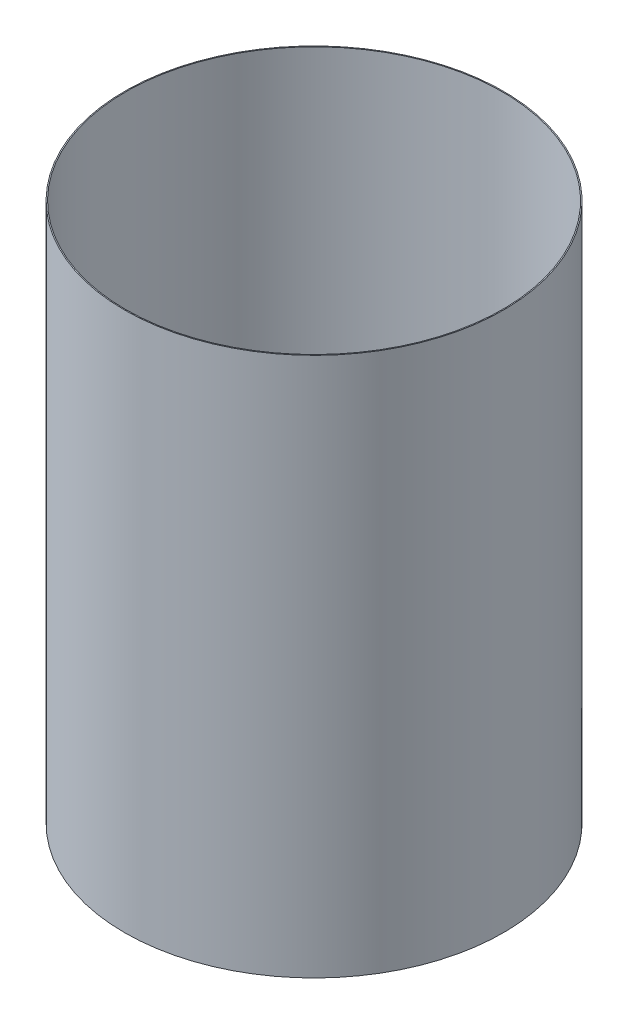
from build123d import *

# Parameters (mm, degrees)
SKETCH1_W = 0.254
SKETCH1_H = 133.35


with BuildPart() as part:
    # Sketch1 → Revolve-Thin1 (revolve)
    with BuildSketch(Plane.XY, mode=Mode.PRIVATE) as revolve_thin1_sk:
        with Locations((-46.736, -86.580914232)):
            Rectangle(SKETCH1_W, SKETCH1_H)
    revolve(revolve_thin1_sk.sketch.rotate(Axis((0, 55, 0), (0, -1, 0)), 270), axis=Axis((0, 55, 0), (0, -1, 0)))


solid = part.part
